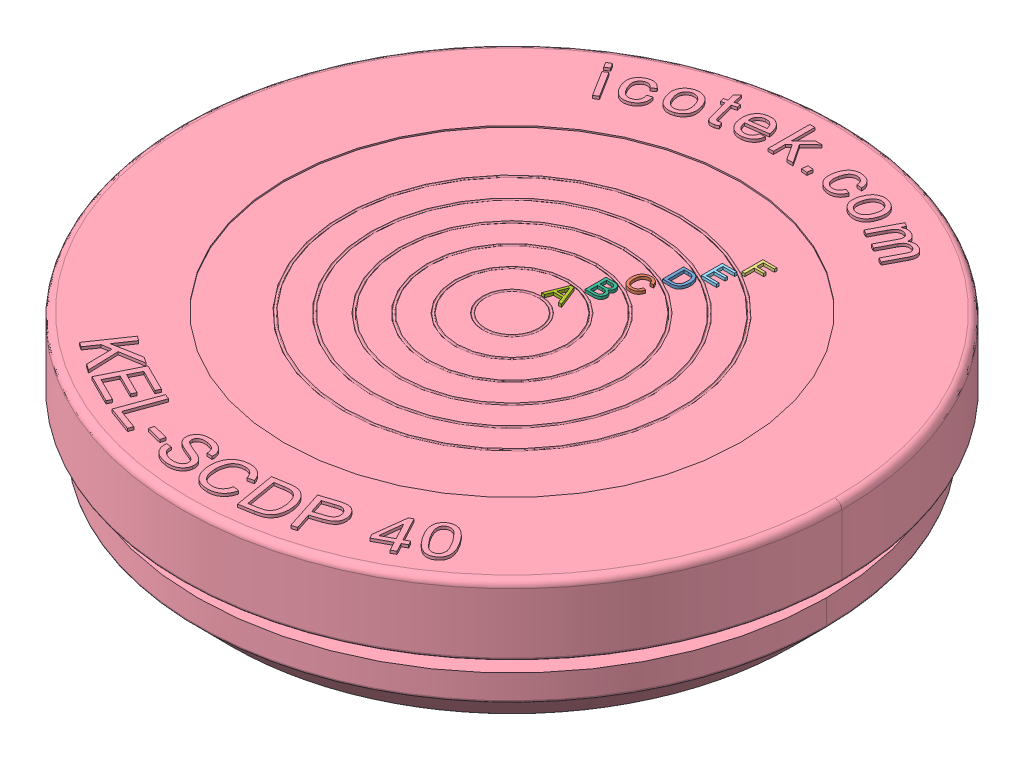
SolidWorks assembly 43482.SLDASM, configuration Default (file format 8000). Lengths in mm.
Overall size (47.2 11 47.2).
7 component instances, 7 part files, 0 mates.
Components (placement in the parent):
- 43482_01-1: 43482_01.SLDPRT [Default] at origin size (1.23 0.2 1.5)
- 43482_02-1: 43482_02.SLDPRT [Default] at origin size (1.31 0.2 1.54)
- 43482_03-1: 43482_03.SLDPRT [Default] at origin size (1 0.2 1.5)
- 43482_04-1: 43482_04.SLDPRT [Default] at origin size (47.2 11 47.2)
- 43482_05-1: 43482_05.SLDPRT [Default] at origin size (1.1 0.2 1.5)
- 43482_06-1: 43482_06.SLDPRT [Default] at origin size (1.12 0.2 1.5)
- 43482_07-1: 43482_07.SLDPRT [Default] at origin size (1.43 0.2 1.5)
